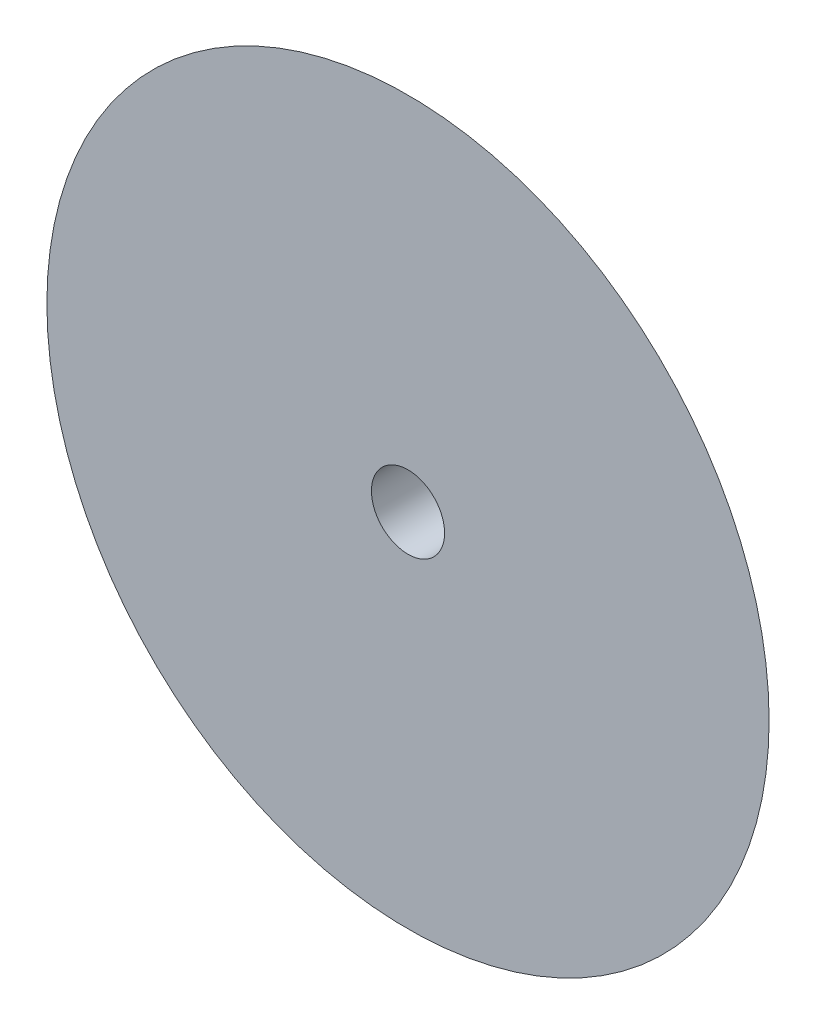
from build123d import *

# Parameters (mm, degrees)
SKETCH2_R          = 4.7625
CUT_EXTRUDE1_DEPTH = 8.89


with BuildPart() as part:
    # Sketch1 → Revolve1 (revolve)
    with BuildSketch(Plane(origin=(0, 0, 0), x_dir=(0, 0, -1), z_dir=(1, 0, 0)), mode=Mode.PRIVATE) as revolve1_sk:
        with BuildLine():
            Line((0, 2.413), (0, 23.8125))
            ThreePointArc((0, 23.8125), (5.200070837, 13.607730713), (7.62, 2.413))
            Line((7.62, 2.413), (0, 2.413))
        make_face()
    revolve(revolve1_sk.sketch.rotate(Axis((0, 0, 44.035869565), (0, 0, -1)), 90), axis=Axis((0, 0, 44.035869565), (0, 0, -1)))

    # Sketch2 → Cut-Extrude1 (cut)
    with BuildSketch(Plane.XY.offset(-12.7)):
        Circle(SKETCH2_R)
    extrude(amount=CUT_EXTRUDE1_DEPTH, mode=Mode.SUBTRACT)


solid = part.part
